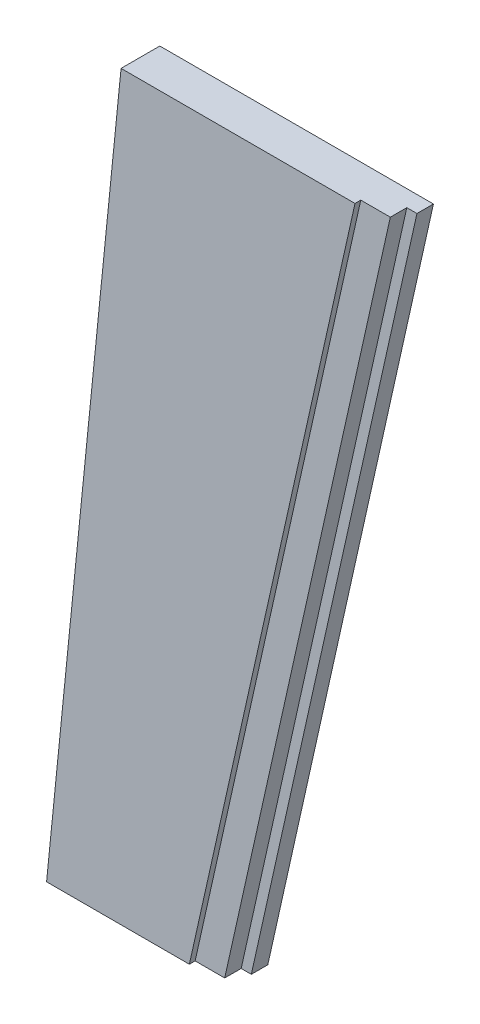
from build123d import *

# Parameters (mm, degrees)
EXTRUDE_1_DEPTH = 47
EXTRUDE_2_DEPTH = 40
EXTRUDE_3_DEPTH = 20


with BuildPart() as part:
    # Sketch 1 → Extrude 1 (new body)
    with BuildSketch(Plane.XY):
        Polygon((-1601.000259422, -900), (-1427.719077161, -900), (-1226.738436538, 0), (-1510.60329461, 0), align=None)
    extrude(amount=EXTRUDE_1_DEPTH)

    # Sketch 2 → Extrude 2 (add)
    with BuildSketch(Plane(origin=(0, 0, 0), x_dir=(-1, 0, 0), z_dir=(0, 0, -1))):
        Polygon((1226.738436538, 0), (1190.876360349, 0), (1391.857000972, -900), (1427.719077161, -900), align=None)
    extrude(amount=-EXTRUDE_2_DEPTH)

    # Sketch 3 → Extrude 3 (add)
    with BuildSketch(Plane(origin=(0, 0, 0), x_dir=(-1, 0, 0), z_dir=(0, 0, -1))):
        Polygon((1190.876360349, 0), (1178.58079137, 0), (1379.561431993, -900), (1391.857000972, -900), align=None)
    extrude(amount=-EXTRUDE_3_DEPTH)


solid = part.part
